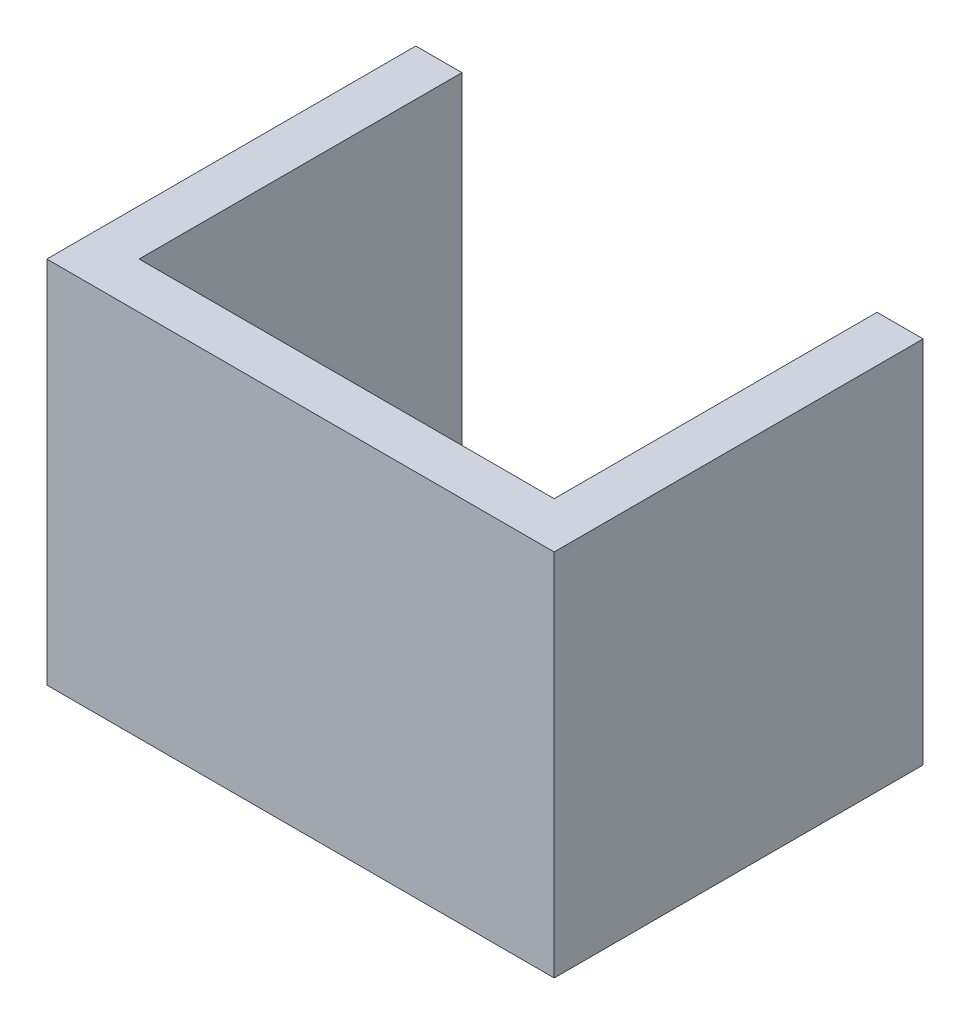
ISO-10303-21;
HEADER;
FILE_DESCRIPTION(('STEP AP214'),'2;1');
FILE_NAME('part.step','',(''),(''),'','','');
FILE_SCHEMA(('AUTOMOTIVE_DESIGN { 1 0 10303 214 1 1 1 1 }'));
ENDSEC;
DATA;
#1=APPLICATION_CONTEXT('core data for automotive mechanical design processes');
#2=APPLICATION_PROTOCOL_DEFINITION('international standard','automotive_design',2000,#1);
#3=PRODUCT_CONTEXT('',#1,'mechanical');
#4=PRODUCT('Part','Part','',(#3));
#5=PRODUCT_RELATED_PRODUCT_CATEGORY('part','',(#4));
#6=PRODUCT_DEFINITION_FORMATION('','',#4);
#7=PRODUCT_DEFINITION_CONTEXT('part definition',#1,'design');
#8=PRODUCT_DEFINITION('design','',#6,#7);
#9=PRODUCT_DEFINITION_SHAPE('','',#8);
#10=(LENGTH_UNIT() NAMED_UNIT(*) SI_UNIT(.MILLI.,.METRE.));
#11=(NAMED_UNIT(*) PLANE_ANGLE_UNIT() SI_UNIT($,.RADIAN.));
#12=(NAMED_UNIT(*) SI_UNIT($,.STERADIAN.) SOLID_ANGLE_UNIT());
#13=UNCERTAINTY_MEASURE_WITH_UNIT(LENGTH_MEASURE(1.E-05),#10,'distance_accuracy_value','');
#14=(GEOMETRIC_REPRESENTATION_CONTEXT(3) GLOBAL_UNCERTAINTY_ASSIGNED_CONTEXT((#13)) GLOBAL_UNIT_ASSIGNED_CONTEXT((#10,
#11,#12)) REPRESENTATION_CONTEXT('',''));
#15=CARTESIAN_POINT('',(0.,0.,0.));
#16=DIRECTION('',(0.,0.,1.));
#17=DIRECTION('',(1.,0.,0.));
#18=AXIS2_PLACEMENT_3D('',#15,#16,#17);
#19=CARTESIAN_POINT('',(0.,203.2,0.));
#20=DIRECTION('',(0.,0.,-1.));
#21=DIRECTION('',(-1.,0.,0.));
#22=AXIS2_PLACEMENT_3D('',#19,#20,#21);
#23=PLANE('',#22);
#24=DIRECTION('',(1.,0.,0.));
#25=VECTOR('',#24,1.);
#26=CARTESIAN_POINT('',(0.,0.,0.));
#27=LINE('',#26,#25);
#28=CARTESIAN_POINT('',(-25.4000000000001,0.,0.));
#29=VERTEX_POINT('',#28);
#30=CARTESIAN_POINT('',(254.000000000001,0.,0.));
#31=VERTEX_POINT('',#30);
#32=EDGE_CURVE('E82',#29,#31,#27,.T.);
#33=ORIENTED_EDGE('',*,*,#32,.T.);
#34=DIRECTION('',(0.,-1.,0.));
#35=VECTOR('',#34,1.);
#36=CARTESIAN_POINT('',(254.000000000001,203.2,0.));
#37=LINE('',#36,#35);
#38=CARTESIAN_POINT('',(254.000000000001,203.2,0.));
#39=VERTEX_POINT('',#38);
#40=EDGE_CURVE('E11',#39,#31,#37,.T.);
#41=ORIENTED_EDGE('',*,*,#40,.F.);
#42=DIRECTION('',(1.,0.,0.));
#43=VECTOR('',#42,1.);
#44=CARTESIAN_POINT('',(0.,203.2,0.));
#45=LINE('',#44,#43);
#46=CARTESIAN_POINT('',(-25.4000000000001,203.2,0.));
#47=VERTEX_POINT('',#46);
#48=EDGE_CURVE('E88',#47,#39,#45,.T.);
#49=ORIENTED_EDGE('',*,*,#48,.F.);
#50=DIRECTION('',(0.,-1.,0.));
#51=VECTOR('',#50,1.);
#52=CARTESIAN_POINT('',(-25.4000000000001,203.2,0.));
#53=LINE('',#52,#51);
#54=EDGE_CURVE('E122',#47,#29,#53,.T.);
#55=ORIENTED_EDGE('',*,*,#54,.T.);
#56=EDGE_LOOP('',(#33,#41,#49,#55));
#57=FACE_BOUND('',#56,.T.);
#58=ADVANCED_FACE('F30',(#57),#23,.F.);
#59=CARTESIAN_POINT('',(254.000000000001,203.2,0.));
#60=DIRECTION('',(-1.,0.,0.));
#61=DIRECTION('',(0.,0.,1.));
#62=AXIS2_PLACEMENT_3D('',#59,#60,#61);
#63=PLANE('',#62);
#64=DIRECTION('',(0.,0.,-1.));
#65=VECTOR('',#64,1.);
#66=CARTESIAN_POINT('',(254.000000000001,0.,0.));
#67=LINE('',#66,#65);
#68=CARTESIAN_POINT('',(254.000000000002,0.,-203.2));
#69=VERTEX_POINT('',#68);
#70=EDGE_CURVE('E127',#31,#69,#67,.T.);
#71=ORIENTED_EDGE('',*,*,#70,.T.);
#72=DIRECTION('',(0.,-1.,0.));
#73=VECTOR('',#72,1.);
#74=CARTESIAN_POINT('',(254.000000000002,203.2,-203.2));
#75=LINE('',#74,#73);
#76=CARTESIAN_POINT('',(254.000000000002,203.2,-203.2));
#77=VERTEX_POINT('',#76);
#78=EDGE_CURVE('E38',#77,#69,#75,.T.);
#79=ORIENTED_EDGE('',*,*,#78,.F.);
#80=DIRECTION('',(0.,0.,-1.));
#81=VECTOR('',#80,1.);
#82=CARTESIAN_POINT('',(254.000000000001,203.2,0.));
#83=LINE('',#82,#81);
#84=EDGE_CURVE('E171',#39,#77,#83,.T.);
#85=ORIENTED_EDGE('',*,*,#84,.F.);
#86=ORIENTED_EDGE('',*,*,#40,.T.);
#87=EDGE_LOOP('',(#71,#79,#85,#86));
#88=FACE_BOUND('',#87,.T.);
#89=ADVANCED_FACE('F173',(#88),#63,.F.);
#90=CARTESIAN_POINT('',(254.000000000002,203.2,-203.2));
#91=DIRECTION('',(0.,0.,1.));
#92=DIRECTION('',(1.,0.,0.));
#93=AXIS2_PLACEMENT_3D('',#90,#91,#92);
#94=PLANE('',#93);
#95=DIRECTION('',(-1.,0.,0.));
#96=VECTOR('',#95,1.);
#97=CARTESIAN_POINT('',(254.000000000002,0.,-203.2));
#98=LINE('',#97,#96);
#99=CARTESIAN_POINT('',(228.600000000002,0.,-203.2));
#100=VERTEX_POINT('',#99);
#101=EDGE_CURVE('E129',#69,#100,#98,.T.);
#102=ORIENTED_EDGE('',*,*,#101,.T.);
#103=DIRECTION('',(0.,-1.,0.));
#104=VECTOR('',#103,1.);
#105=CARTESIAN_POINT('',(228.600000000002,203.2,-203.2));
#106=LINE('',#105,#104);
#107=CARTESIAN_POINT('',(228.600000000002,203.2,-203.2));
#108=VERTEX_POINT('',#107);
#109=EDGE_CURVE('E146',#108,#100,#106,.T.);
#110=ORIENTED_EDGE('',*,*,#109,.F.);
#111=DIRECTION('',(-1.,0.,0.));
#112=VECTOR('',#111,1.);
#113=CARTESIAN_POINT('',(254.000000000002,203.2,-203.2));
#114=LINE('',#113,#112);
#115=EDGE_CURVE('E155',#77,#108,#114,.T.);
#116=ORIENTED_EDGE('',*,*,#115,.F.);
#117=ORIENTED_EDGE('',*,*,#78,.T.);
#118=EDGE_LOOP('',(#102,#110,#116,#117));
#119=FACE_BOUND('',#118,.T.);
#120=ADVANCED_FACE('F153',(#119),#94,.F.);
#121=CARTESIAN_POINT('',(228.600000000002,203.2,-203.2));
#122=DIRECTION('',(1.,0.,0.));
#123=DIRECTION('',(0.,0.,-1.));
#124=AXIS2_PLACEMENT_3D('',#121,#122,#123);
#125=PLANE('',#124);
#126=DIRECTION('',(0.,0.,1.));
#127=VECTOR('',#126,1.);
#128=CARTESIAN_POINT('',(228.600000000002,0.,-203.2));
#129=LINE('',#128,#127);
#130=CARTESIAN_POINT('',(228.600000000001,0.,-25.4000000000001));
#131=VERTEX_POINT('',#130);
#132=EDGE_CURVE('E131',#100,#131,#129,.T.);
#133=ORIENTED_EDGE('',*,*,#132,.T.);
#134=DIRECTION('',(0.,-1.,0.));
#135=VECTOR('',#134,1.);
#136=CARTESIAN_POINT('',(228.600000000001,203.2,-25.4000000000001));
#137=LINE('',#136,#135);
#138=CARTESIAN_POINT('',(228.600000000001,203.2,-25.4000000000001));
#139=VERTEX_POINT('',#138);
#140=EDGE_CURVE('E143',#139,#131,#137,.T.);
#141=ORIENTED_EDGE('',*,*,#140,.F.);
#142=DIRECTION('',(0.,0.,1.));
#143=VECTOR('',#142,1.);
#144=CARTESIAN_POINT('',(228.600000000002,203.2,-203.2));
#145=LINE('',#144,#143);
#146=EDGE_CURVE('E167',#108,#139,#145,.T.);
#147=ORIENTED_EDGE('',*,*,#146,.F.);
#148=ORIENTED_EDGE('',*,*,#109,.T.);
#149=EDGE_LOOP('',(#133,#141,#147,#148));
#150=FACE_BOUND('',#149,.T.);
#151=ADVANCED_FACE('F163',(#150),#125,.F.);
#152=CARTESIAN_POINT('',(228.600000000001,203.2,-25.4000000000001));
#153=DIRECTION('',(0.,0.,1.));
#154=DIRECTION('',(1.,0.,0.));
#155=AXIS2_PLACEMENT_3D('',#152,#153,#154);
#156=PLANE('',#155);
#157=DIRECTION('',(-1.,0.,0.));
#158=VECTOR('',#157,1.);
#159=CARTESIAN_POINT('',(228.600000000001,0.,-25.4000000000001));
#160=LINE('',#159,#158);
#161=CARTESIAN_POINT('',(0.,0.,-25.4000000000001));
#162=VERTEX_POINT('',#161);
#163=EDGE_CURVE('E133',#131,#162,#160,.T.);
#164=ORIENTED_EDGE('',*,*,#163,.T.);
#165=DIRECTION('',(0.,-1.,0.));
#166=VECTOR('',#165,1.);
#167=CARTESIAN_POINT('',(0.,203.2,-25.4000000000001));
#168=LINE('',#167,#166);
#169=CARTESIAN_POINT('',(0.,203.2,-25.4000000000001));
#170=VERTEX_POINT('',#169);
#171=EDGE_CURVE('E117',#170,#162,#168,.T.);
#172=ORIENTED_EDGE('',*,*,#171,.F.);
#173=DIRECTION('',(-1.,0.,0.));
#174=VECTOR('',#173,1.);
#175=CARTESIAN_POINT('',(228.600000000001,203.2,-25.4000000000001));
#176=LINE('',#175,#174);
#177=EDGE_CURVE('E108',#139,#170,#176,.T.);
#178=ORIENTED_EDGE('',*,*,#177,.F.);
#179=ORIENTED_EDGE('',*,*,#140,.T.);
#180=EDGE_LOOP('',(#164,#172,#178,#179));
#181=FACE_BOUND('',#180,.T.);
#182=ADVANCED_FACE('F166',(#181),#156,.F.);
#183=CARTESIAN_POINT('',(0.,203.2,-203.2));
#184=DIRECTION('',(-1.,0.,0.));
#185=DIRECTION('',(0.,0.,1.));
#186=AXIS2_PLACEMENT_3D('',#183,#184,#185);
#187=PLANE('',#186);
#188=DIRECTION('',(0.,0.,-1.));
#189=VECTOR('',#188,1.);
#190=CARTESIAN_POINT('',(0.,0.,-203.2));
#191=LINE('',#190,#189);
#192=CARTESIAN_POINT('',(0.,0.,-203.2));
#193=VERTEX_POINT('',#192);
#194=EDGE_CURVE('E116',#162,#193,#191,.T.);
#195=ORIENTED_EDGE('',*,*,#194,.T.);
#196=DIRECTION('',(0.,-1.,0.));
#197=VECTOR('',#196,1.);
#198=CARTESIAN_POINT('',(0.,203.2,-203.2));
#199=LINE('',#198,#197);
#200=CARTESIAN_POINT('',(0.,203.2,-203.2));
#201=VERTEX_POINT('',#200);
#202=EDGE_CURVE('E113',#201,#193,#199,.T.);
#203=ORIENTED_EDGE('',*,*,#202,.F.);
#204=DIRECTION('',(0.,0.,-1.));
#205=VECTOR('',#204,1.);
#206=CARTESIAN_POINT('',(0.,203.2,-203.2));
#207=LINE('',#206,#205);
#208=EDGE_CURVE('E102',#170,#201,#207,.T.);
#209=ORIENTED_EDGE('',*,*,#208,.F.);
#210=ORIENTED_EDGE('',*,*,#171,.T.);
#211=EDGE_LOOP('',(#195,#203,#209,#210));
#212=FACE_BOUND('',#211,.T.);
#213=ADVANCED_FACE('F114',(#212),#187,.F.);
#214=CARTESIAN_POINT('',(-25.4000000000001,203.2,-203.2));
#215=DIRECTION('',(0.,0.,1.));
#216=DIRECTION('',(1.,0.,0.));
#217=AXIS2_PLACEMENT_3D('',#214,#215,#216);
#218=PLANE('',#217);
#219=DIRECTION('',(-1.,0.,0.));
#220=VECTOR('',#219,1.);
#221=CARTESIAN_POINT('',(-25.4000000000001,0.,-203.2));
#222=LINE('',#221,#220);
#223=CARTESIAN_POINT('',(-25.4000000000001,0.,-203.2));
#224=VERTEX_POINT('',#223);
#225=EDGE_CURVE('E75',#193,#224,#222,.T.);
#226=ORIENTED_EDGE('',*,*,#225,.T.);
#227=DIRECTION('',(0.,-1.,0.));
#228=VECTOR('',#227,1.);
#229=CARTESIAN_POINT('',(-25.4000000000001,203.2,-203.2));
#230=LINE('',#229,#228);
#231=CARTESIAN_POINT('',(-25.4000000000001,203.2,-203.2));
#232=VERTEX_POINT('',#231);
#233=EDGE_CURVE('E118',#232,#224,#230,.T.);
#234=ORIENTED_EDGE('',*,*,#233,.F.);
#235=DIRECTION('',(-1.,0.,0.));
#236=VECTOR('',#235,1.);
#237=CARTESIAN_POINT('',(-25.4000000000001,203.2,-203.2));
#238=LINE('',#237,#236);
#239=EDGE_CURVE('E106',#201,#232,#238,.T.);
#240=ORIENTED_EDGE('',*,*,#239,.F.);
#241=ORIENTED_EDGE('',*,*,#202,.T.);
#242=EDGE_LOOP('',(#226,#234,#240,#241));
#243=FACE_BOUND('',#242,.T.);
#244=ADVANCED_FACE('F120',(#243),#218,.F.);
#245=CARTESIAN_POINT('',(-25.4000000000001,203.2,0.));
#246=DIRECTION('',(1.,0.,0.));
#247=DIRECTION('',(0.,0.,-1.));
#248=AXIS2_PLACEMENT_3D('',#245,#246,#247);
#249=PLANE('',#248);
#250=DIRECTION('',(0.,0.,1.));
#251=VECTOR('',#250,1.);
#252=CARTESIAN_POINT('',(-25.4000000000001,0.,0.));
#253=LINE('',#252,#251);
#254=EDGE_CURVE('E137',#224,#29,#253,.T.);
#255=ORIENTED_EDGE('',*,*,#254,.T.);
#256=ORIENTED_EDGE('',*,*,#54,.F.);
#257=DIRECTION('',(0.,0.,1.));
#258=VECTOR('',#257,1.);
#259=CARTESIAN_POINT('',(-25.4000000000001,203.2,0.));
#260=LINE('',#259,#258);
#261=EDGE_CURVE('E46',#232,#47,#260,.T.);
#262=ORIENTED_EDGE('',*,*,#261,.F.);
#263=ORIENTED_EDGE('',*,*,#233,.T.);
#264=EDGE_LOOP('',(#255,#256,#262,#263));
#265=FACE_BOUND('',#264,.T.);
#266=ADVANCED_FACE('F176',(#265),#249,.F.);
#267=CARTESIAN_POINT('',(0.,203.2,0.));
#268=DIRECTION('',(0.,-1.,0.));
#269=DIRECTION('',(0.,0.,-1.));
#270=AXIS2_PLACEMENT_3D('',#267,#268,#269);
#271=PLANE('',#270);
#272=ORIENTED_EDGE('',*,*,#48,.T.);
#273=ORIENTED_EDGE('',*,*,#84,.T.);
#274=ORIENTED_EDGE('',*,*,#115,.T.);
#275=ORIENTED_EDGE('',*,*,#146,.T.);
#276=ORIENTED_EDGE('',*,*,#177,.T.);
#277=ORIENTED_EDGE('',*,*,#208,.T.);
#278=ORIENTED_EDGE('',*,*,#239,.T.);
#279=ORIENTED_EDGE('',*,*,#261,.T.);
#280=EDGE_LOOP('',(#272,#273,#274,#275,#276,#277,#278,#279));
#281=FACE_BOUND('',#280,.T.);
#282=ADVANCED_FACE('F104',(#281),#271,.F.);
#283=CARTESIAN_POINT('',(0.,0.,0.));
#284=DIRECTION('',(0.,-1.,0.));
#285=DIRECTION('',(0.,0.,-1.));
#286=AXIS2_PLACEMENT_3D('',#283,#284,#285);
#287=PLANE('',#286);
#288=ORIENTED_EDGE('',*,*,#32,.F.);
#289=ORIENTED_EDGE('',*,*,#254,.F.);
#290=ORIENTED_EDGE('',*,*,#225,.F.);
#291=ORIENTED_EDGE('',*,*,#194,.F.);
#292=ORIENTED_EDGE('',*,*,#163,.F.);
#293=ORIENTED_EDGE('',*,*,#132,.F.);
#294=ORIENTED_EDGE('',*,*,#101,.F.);
#295=ORIENTED_EDGE('',*,*,#70,.F.);
#296=EDGE_LOOP('',(#288,#289,#290,#291,#292,#293,#294,#295));
#297=FACE_BOUND('',#296,.T.);
#298=ADVANCED_FACE('F159',(#297),#287,.T.);
#299=CLOSED_SHELL('',(#58,#89,#120,#151,#182,#213,#244,#266,#282,#298));
#300=MANIFOLD_SOLID_BREP('B2',#299);
#301=ADVANCED_BREP_SHAPE_REPRESENTATION('',(#18,#300),#14);
#302=SHAPE_DEFINITION_REPRESENTATION(#9,#301);
ENDSEC;
END-ISO-10303-21;
